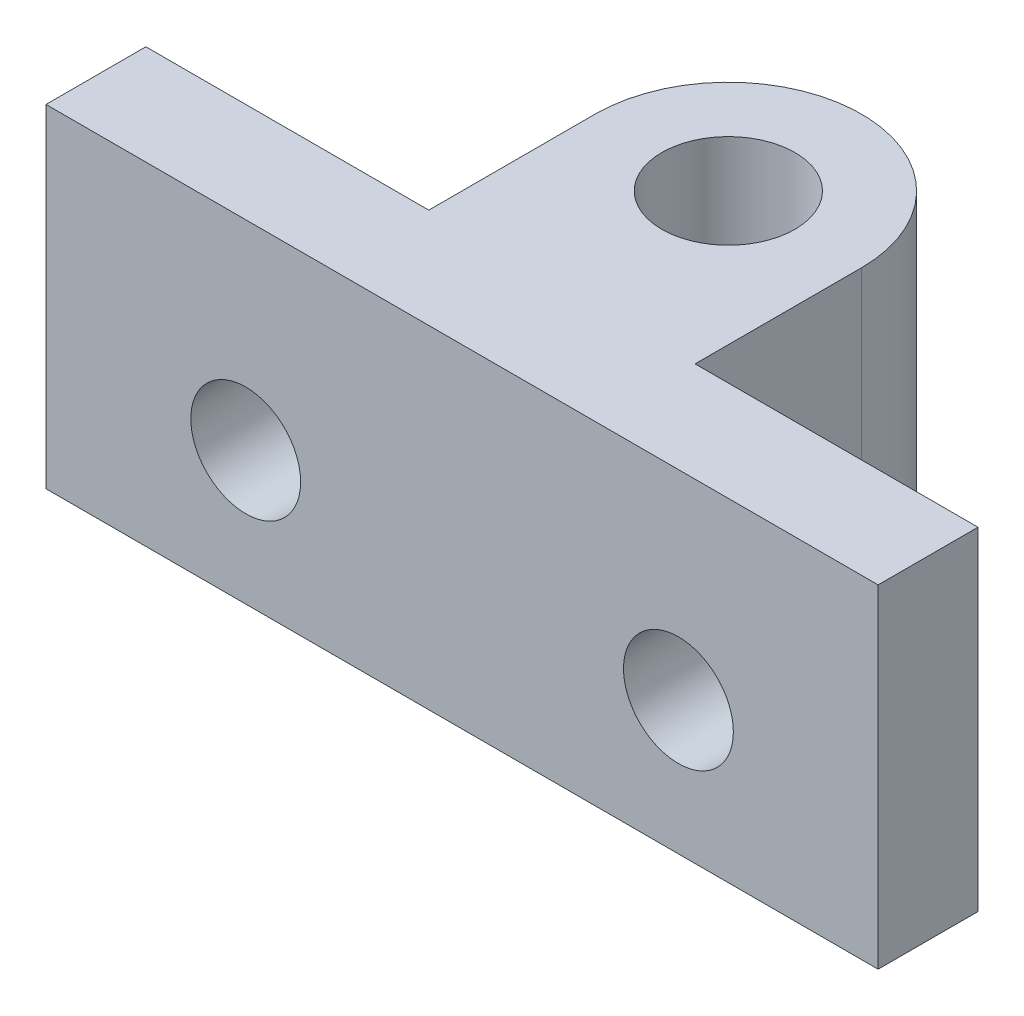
from build123d import *

# Parameters (mm, degrees)
SKETCH_2_R              = 2
EXTRUDE_1_DEPTH         = 10
HOLE_WIZARD_3_3_3_3_1_D = 3.3


with BuildPart() as part:
    # Sketch 2 → Extrude 1 (new body)
    with BuildSketch(Plane(origin=(0, 0, 0), x_dir=(1, 0, 0), z_dir=(0, 1, 0))):
        with BuildLine():
            Line((16.5, 3), (16.5, 8))
            ThreePointArc((16.5, 8), (12.5, 12), (8.5, 8))
            Line((8.5, 8), (8.5, 3))
            Line((8.5, 3), (0, 3))
            Line((0, 3), (0, 0))
            Line((0, 0), (25, 0))
            Line((25, 0), (25, 3))
            Line((25, 3), (16.5, 3))
        make_face()
        with Locations(Location((12.5, 8, 0), (0, 0, 270))):
            Circle(SKETCH_2_R, mode=Mode.SUBTRACT)
    extrude(amount=EXTRUDE_1_DEPTH)

    # Hole Wizard 3.3 _3.3_ _1 (through all)
    with Locations(Plane.XY):
        with Locations((6.000007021, 3.999996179), (19.000007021, 3.999996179)):
            Hole(HOLE_WIZARD_3_3_3_3_1_D / 2)


solid = part.part
